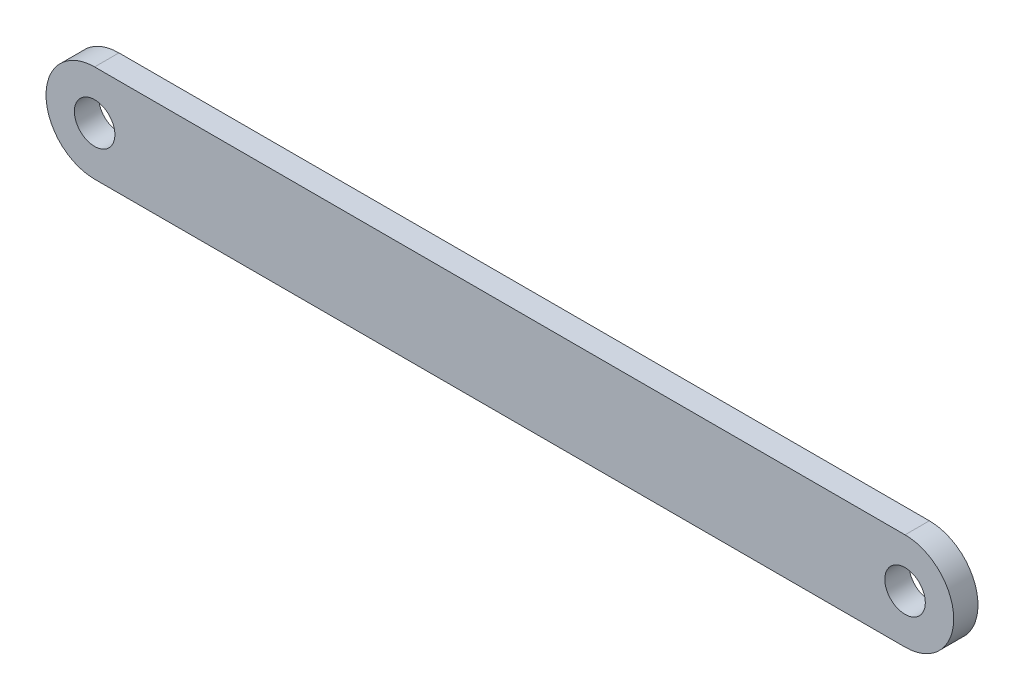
ISO-10303-21;
HEADER;
FILE_DESCRIPTION(('STEP AP214'),'2;1');
FILE_NAME('part.step','',(''),(''),'','','');
FILE_SCHEMA(('AUTOMOTIVE_DESIGN { 1 0 10303 214 1 1 1 1 }'));
ENDSEC;
DATA;
#1=APPLICATION_CONTEXT('core data for automotive mechanical design processes');
#2=APPLICATION_PROTOCOL_DEFINITION('international standard','automotive_design',2000,#1);
#3=PRODUCT_CONTEXT('',#1,'mechanical');
#4=PRODUCT('Part','Part','',(#3));
#5=PRODUCT_RELATED_PRODUCT_CATEGORY('part','',(#4));
#6=PRODUCT_DEFINITION_FORMATION('','',#4);
#7=PRODUCT_DEFINITION_CONTEXT('part definition',#1,'design');
#8=PRODUCT_DEFINITION('design','',#6,#7);
#9=PRODUCT_DEFINITION_SHAPE('','',#8);
#10=(LENGTH_UNIT() NAMED_UNIT(*) SI_UNIT(.MILLI.,.METRE.));
#11=(NAMED_UNIT(*) PLANE_ANGLE_UNIT() SI_UNIT($,.RADIAN.));
#12=(NAMED_UNIT(*) SI_UNIT($,.STERADIAN.) SOLID_ANGLE_UNIT());
#13=UNCERTAINTY_MEASURE_WITH_UNIT(LENGTH_MEASURE(1.E-05),#10,'distance_accuracy_value','');
#14=(GEOMETRIC_REPRESENTATION_CONTEXT(3) GLOBAL_UNCERTAINTY_ASSIGNED_CONTEXT((#13)) GLOBAL_UNIT_ASSIGNED_CONTEXT((#10,
#11,#12)) REPRESENTATION_CONTEXT('',''));
#15=CARTESIAN_POINT('',(0.,0.,0.));
#16=DIRECTION('',(0.,0.,1.));
#17=DIRECTION('',(1.,0.,0.));
#18=AXIS2_PLACEMENT_3D('',#15,#16,#17);
#19=CARTESIAN_POINT('',(50.,0.,1.5));
#20=DIRECTION('',(0.,0.,-1.));
#21=DIRECTION('',(-1.,0.,0.));
#22=AXIS2_PLACEMENT_3D('',#19,#20,#21);
#23=PLANE('',#22);
#24=CARTESIAN_POINT('',(50.,0.,1.5));
#25=DIRECTION('',(0.,0.,1.));
#26=DIRECTION('',(-1.,0.,0.));
#27=AXIS2_PLACEMENT_3D('',#24,#25,#26);
#28=CIRCLE('',#27,6.);
#29=CARTESIAN_POINT('',(50.,-6.,1.5));
#30=VERTEX_POINT('',#29);
#31=CARTESIAN_POINT('',(50.,6.,1.5));
#32=VERTEX_POINT('',#31);
#33=EDGE_CURVE('E90',#30,#32,#28,.T.);
#34=ORIENTED_EDGE('',*,*,#33,.T.);
#35=DIRECTION('',(-1.,0.,0.));
#36=VECTOR('',#35,1.);
#37=CARTESIAN_POINT('',(-50.,6.,1.5));
#38=LINE('',#37,#36);
#39=CARTESIAN_POINT('',(-50.,6.,1.5));
#40=VERTEX_POINT('',#39);
#41=EDGE_CURVE('E85',#32,#40,#38,.T.);
#42=ORIENTED_EDGE('',*,*,#41,.T.);
#43=CARTESIAN_POINT('',(-50.,0.,1.5));
#44=DIRECTION('',(0.,0.,1.));
#45=DIRECTION('',(1.,0.,0.));
#46=AXIS2_PLACEMENT_3D('',#43,#44,#45);
#47=CIRCLE('',#46,6.);
#48=CARTESIAN_POINT('',(-50.,-6.,1.5));
#49=VERTEX_POINT('',#48);
#50=EDGE_CURVE('E88',#40,#49,#47,.T.);
#51=ORIENTED_EDGE('',*,*,#50,.T.);
#52=DIRECTION('',(1.,0.,0.));
#53=VECTOR('',#52,1.);
#54=CARTESIAN_POINT('',(50.,-6.,1.5));
#55=LINE('',#54,#53);
#56=EDGE_CURVE('E55',#49,#30,#55,.T.);
#57=ORIENTED_EDGE('',*,*,#56,.T.);
#58=EDGE_LOOP('',(#34,#42,#51,#57));
#59=FACE_BOUND('',#58,.T.);
#60=CARTESIAN_POINT('',(50.,0.,1.5));
#61=DIRECTION('',(0.,0.,1.));
#62=DIRECTION('',(1.,0.,0.));
#63=AXIS2_PLACEMENT_3D('',#60,#61,#62);
#64=CIRCLE('',#63,2.5);
#65=CARTESIAN_POINT('',(52.5,0.,1.5));
#66=VERTEX_POINT('',#65);
#67=EDGE_CURVE('E105',#66,#66,#64,.T.);
#68=ORIENTED_EDGE('',*,*,#67,.F.);
#69=EDGE_LOOP('',(#68));
#70=FACE_BOUND('',#69,.T.);
#71=CARTESIAN_POINT('',(-50.,0.,1.5));
#72=DIRECTION('',(0.,0.,1.));
#73=DIRECTION('',(1.,0.,0.));
#74=AXIS2_PLACEMENT_3D('',#71,#72,#73);
#75=CIRCLE('',#74,2.5);
#76=CARTESIAN_POINT('',(-47.5,0.,1.5));
#77=VERTEX_POINT('',#76);
#78=EDGE_CURVE('E120',#77,#77,#75,.T.);
#79=ORIENTED_EDGE('',*,*,#78,.F.);
#80=EDGE_LOOP('',(#79));
#81=FACE_BOUND('',#80,.T.);
#82=ADVANCED_FACE('F38',(#59,#70,#81),#23,.F.);
#83=CARTESIAN_POINT('',(50.,0.,-1.5));
#84=DIRECTION('',(0.,0.,-1.));
#85=DIRECTION('',(-1.,0.,0.));
#86=AXIS2_PLACEMENT_3D('',#83,#84,#85);
#87=PLANE('',#86);
#88=CARTESIAN_POINT('',(50.,0.,-1.5));
#89=DIRECTION('',(0.,0.,1.));
#90=DIRECTION('',(1.,0.,0.));
#91=AXIS2_PLACEMENT_3D('',#88,#89,#90);
#92=CIRCLE('',#91,2.5);
#93=CARTESIAN_POINT('',(52.5,0.,-1.5));
#94=VERTEX_POINT('',#93);
#95=EDGE_CURVE('E117',#94,#94,#92,.T.);
#96=ORIENTED_EDGE('',*,*,#95,.T.);
#97=EDGE_LOOP('',(#96));
#98=FACE_BOUND('',#97,.T.);
#99=CARTESIAN_POINT('',(50.,0.,-1.5));
#100=DIRECTION('',(0.,0.,1.));
#101=DIRECTION('',(-1.,0.,0.));
#102=AXIS2_PLACEMENT_3D('',#99,#100,#101);
#103=CIRCLE('',#102,6.);
#104=CARTESIAN_POINT('',(50.,-6.,-1.5));
#105=VERTEX_POINT('',#104);
#106=CARTESIAN_POINT('',(50.,6.,-1.5));
#107=VERTEX_POINT('',#106);
#108=EDGE_CURVE('E102',#105,#107,#103,.T.);
#109=ORIENTED_EDGE('',*,*,#108,.F.);
#110=DIRECTION('',(1.,0.,0.));
#111=VECTOR('',#110,1.);
#112=CARTESIAN_POINT('',(50.,-6.,-1.5));
#113=LINE('',#112,#111);
#114=CARTESIAN_POINT('',(-50.,-6.,-1.5));
#115=VERTEX_POINT('',#114);
#116=EDGE_CURVE('E78',#115,#105,#113,.T.);
#117=ORIENTED_EDGE('',*,*,#116,.F.);
#118=CARTESIAN_POINT('',(-50.,0.,-1.5));
#119=DIRECTION('',(0.,0.,1.));
#120=DIRECTION('',(1.,0.,0.));
#121=AXIS2_PLACEMENT_3D('',#118,#119,#120);
#122=CIRCLE('',#121,6.);
#123=CARTESIAN_POINT('',(-50.,6.,-1.5));
#124=VERTEX_POINT('',#123);
#125=EDGE_CURVE('E72',#124,#115,#122,.T.);
#126=ORIENTED_EDGE('',*,*,#125,.F.);
#127=DIRECTION('',(-1.,0.,0.));
#128=VECTOR('',#127,1.);
#129=CARTESIAN_POINT('',(-50.,6.,-1.5));
#130=LINE('',#129,#128);
#131=EDGE_CURVE('E94',#107,#124,#130,.T.);
#132=ORIENTED_EDGE('',*,*,#131,.F.);
#133=EDGE_LOOP('',(#109,#117,#126,#132));
#134=FACE_BOUND('',#133,.T.);
#135=CARTESIAN_POINT('',(-50.,0.,-1.5));
#136=DIRECTION('',(0.,0.,1.));
#137=DIRECTION('',(1.,0.,0.));
#138=AXIS2_PLACEMENT_3D('',#135,#136,#137);
#139=CIRCLE('',#138,2.5);
#140=CARTESIAN_POINT('',(-47.5,0.,-1.5));
#141=VERTEX_POINT('',#140);
#142=EDGE_CURVE('E123',#141,#141,#139,.T.);
#143=ORIENTED_EDGE('',*,*,#142,.T.);
#144=EDGE_LOOP('',(#143));
#145=FACE_BOUND('',#144,.T.);
#146=ADVANCED_FACE('F113',(#98,#134,#145),#87,.T.);
#147=CARTESIAN_POINT('',(50.,0.,1.5));
#148=DIRECTION('',(0.,0.,-1.));
#149=DIRECTION('',(-1.,0.,0.));
#150=AXIS2_PLACEMENT_3D('',#147,#148,#149);
#151=CYLINDRICAL_SURFACE('',#150,6.);
#152=ORIENTED_EDGE('',*,*,#108,.T.);
#153=DIRECTION('',(0.,0.,-1.));
#154=VECTOR('',#153,1.);
#155=CARTESIAN_POINT('',(50.,6.,1.5));
#156=LINE('',#155,#154);
#157=EDGE_CURVE('E11',#32,#107,#156,.T.);
#158=ORIENTED_EDGE('',*,*,#157,.F.);
#159=ORIENTED_EDGE('',*,*,#33,.F.);
#160=DIRECTION('',(0.,0.,-1.));
#161=VECTOR('',#160,1.);
#162=CARTESIAN_POINT('',(50.,-6.,1.5));
#163=LINE('',#162,#161);
#164=EDGE_CURVE('E98',#30,#105,#163,.T.);
#165=ORIENTED_EDGE('',*,*,#164,.T.);
#166=EDGE_LOOP('',(#152,#158,#159,#165));
#167=FACE_BOUND('',#166,.T.);
#168=ADVANCED_FACE('F40',(#167),#151,.T.);
#169=CARTESIAN_POINT('',(-50.,6.,1.5));
#170=DIRECTION('',(0.,-1.,0.));
#171=DIRECTION('',(0.,0.,-1.));
#172=AXIS2_PLACEMENT_3D('',#169,#170,#171);
#173=PLANE('',#172);
#174=ORIENTED_EDGE('',*,*,#131,.T.);
#175=DIRECTION('',(0.,0.,-1.));
#176=VECTOR('',#175,1.);
#177=CARTESIAN_POINT('',(-50.,6.,1.5));
#178=LINE('',#177,#176);
#179=EDGE_CURVE('E47',#40,#124,#178,.T.);
#180=ORIENTED_EDGE('',*,*,#179,.F.);
#181=ORIENTED_EDGE('',*,*,#41,.F.);
#182=ORIENTED_EDGE('',*,*,#157,.T.);
#183=EDGE_LOOP('',(#174,#180,#181,#182));
#184=FACE_BOUND('',#183,.T.);
#185=ADVANCED_FACE('F93',(#184),#173,.F.);
#186=CARTESIAN_POINT('',(-50.,0.,1.5));
#187=DIRECTION('',(0.,0.,-1.));
#188=DIRECTION('',(-1.,0.,0.));
#189=AXIS2_PLACEMENT_3D('',#186,#187,#188);
#190=CYLINDRICAL_SURFACE('',#189,6.);
#191=ORIENTED_EDGE('',*,*,#125,.T.);
#192=DIRECTION('',(0.,0.,-1.));
#193=VECTOR('',#192,1.);
#194=CARTESIAN_POINT('',(-50.,-6.,1.5));
#195=LINE('',#194,#193);
#196=EDGE_CURVE('E95',#49,#115,#195,.T.);
#197=ORIENTED_EDGE('',*,*,#196,.F.);
#198=ORIENTED_EDGE('',*,*,#50,.F.);
#199=ORIENTED_EDGE('',*,*,#179,.T.);
#200=EDGE_LOOP('',(#191,#197,#198,#199));
#201=FACE_BOUND('',#200,.T.);
#202=ADVANCED_FACE('F96',(#201),#190,.T.);
#203=CARTESIAN_POINT('',(50.,-6.,1.5));
#204=DIRECTION('',(0.,1.,0.));
#205=DIRECTION('',(0.,0.,1.));
#206=AXIS2_PLACEMENT_3D('',#203,#204,#205);
#207=PLANE('',#206);
#208=ORIENTED_EDGE('',*,*,#116,.T.);
#209=ORIENTED_EDGE('',*,*,#164,.F.);
#210=ORIENTED_EDGE('',*,*,#56,.F.);
#211=ORIENTED_EDGE('',*,*,#196,.T.);
#212=EDGE_LOOP('',(#208,#209,#210,#211));
#213=FACE_BOUND('',#212,.T.);
#214=ADVANCED_FACE('F110',(#213),#207,.F.);
#215=CARTESIAN_POINT('',(50.,0.,1.5));
#216=DIRECTION('',(0.,0.,-1.));
#217=DIRECTION('',(-1.,0.,0.));
#218=AXIS2_PLACEMENT_3D('',#215,#216,#217);
#219=CYLINDRICAL_SURFACE('',#218,2.5);
#220=ORIENTED_EDGE('',*,*,#67,.T.);
#221=EDGE_LOOP('',(#220));
#222=FACE_BOUND('',#221,.T.);
#223=ORIENTED_EDGE('',*,*,#95,.F.);
#224=EDGE_LOOP('',(#223));
#225=FACE_BOUND('',#224,.T.);
#226=ADVANCED_FACE('F140',(#222,#225),#219,.F.);
#227=CARTESIAN_POINT('',(-50.,0.,1.5));
#228=DIRECTION('',(0.,0.,-1.));
#229=DIRECTION('',(-1.,0.,0.));
#230=AXIS2_PLACEMENT_3D('',#227,#228,#229);
#231=CYLINDRICAL_SURFACE('',#230,2.5);
#232=ORIENTED_EDGE('',*,*,#78,.T.);
#233=EDGE_LOOP('',(#232));
#234=FACE_BOUND('',#233,.T.);
#235=ORIENTED_EDGE('',*,*,#142,.F.);
#236=EDGE_LOOP('',(#235));
#237=FACE_BOUND('',#236,.T.);
#238=ADVANCED_FACE('F129',(#234,#237),#231,.F.);
#239=CLOSED_SHELL('',(#82,#146,#168,#185,#202,#214,#226,#238));
#240=MANIFOLD_SOLID_BREP('B2',#239);
#241=ADVANCED_BREP_SHAPE_REPRESENTATION('',(#18,#240),#14);
#242=SHAPE_DEFINITION_REPRESENTATION(#9,#241);
ENDSEC;
END-ISO-10303-21;
